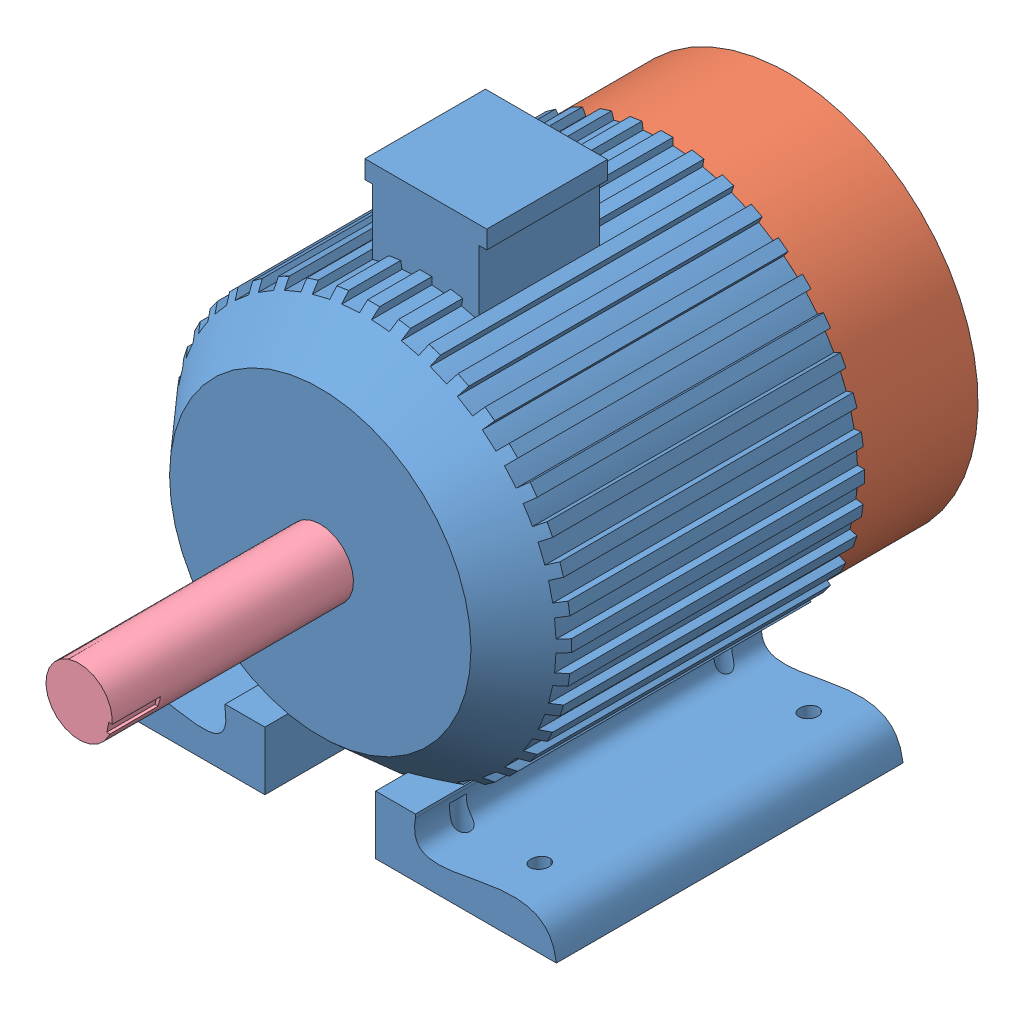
SolidWorks assembly moteur asynchrone.SLDASM, configuration Default (file format 13000). Lengths in mm.
Overall size (783.28 821.53 1185.08).
4 component instances, 4 part files, 6 mates.
Components (placement in the parent):
- carcase-1: carcase.SLDPRT [Default] at (708.3482 517.0461 625.0993) size (783.28 821.53 575.04)
- ghita22-1: ghita22.SLDPRT [Default] at (708.3482 517.0461 -149.9803) x (1 0 0) z (0 -1 0) size (632 210.04 632)
- rotor-1: rotor.SLDPRT [Default] at (708.3482 517.0461 175.0993) x (1 0 0) z (0 -1 0) size (350 350 350)
- stator-1: stator.SLDPRT [Default] at (708.3482 517.0461 425.0993) x (0.19332 0.981136 0) z (0 0 -1) size (198.11 178.92 800)
Mates (geometry in assembly coordinates):
- Concentric1: concentric anti-aligned: cylinder of carcase-1 through (708.3482 517.0461 -308.9007) axis (0 0 1) radius 55; cylinder of stator-1 through (708.3482 517.0461 1025.0993) axis (0 0 -1) radius 55
- Distance2: distance = 400 mm aligned: plane of stator-1 through (708.3482 517.0461 1025.0993) normal (0 0 1); plane of carcase-1 through (708.3482 517.0461 625.0993) normal (0 0 1)
- Concentric2: concentric anti-aligned: cylinder of rotor-1 through (708.3482 517.0461 525.0993) axis (0 0 -1) radius 100; cylinder of stator-1 through (708.3482 517.0461 225.0993) axis (0 0 1) radius 100
- Distance3: distance = 50 mm aligned: plane of stator-1 through (708.3482 517.0461 225.0993) normal (0 0 -1); plane of rotor-1 through (708.3482 517.0461 175.0993) normal (0 0 -1)
- Coincident4: coincident anti-aligned: plane of carcase-1 through (1014.446 517.0461 50.0588) normal (0 0 -1); plane of ghita22-1 through (1024.3482 517.0461 50.0588) normal (0 0 1)
- Concentric3: concentric anti-aligned: cylinder of carcase-1 through (708.3482 517.0461 625.0993) axis (0 0 1) radius 306.0978; cylinder of ghita22-1 through (708.3482 517.0461 -149.9803) axis (0 0 -1) radius 316
